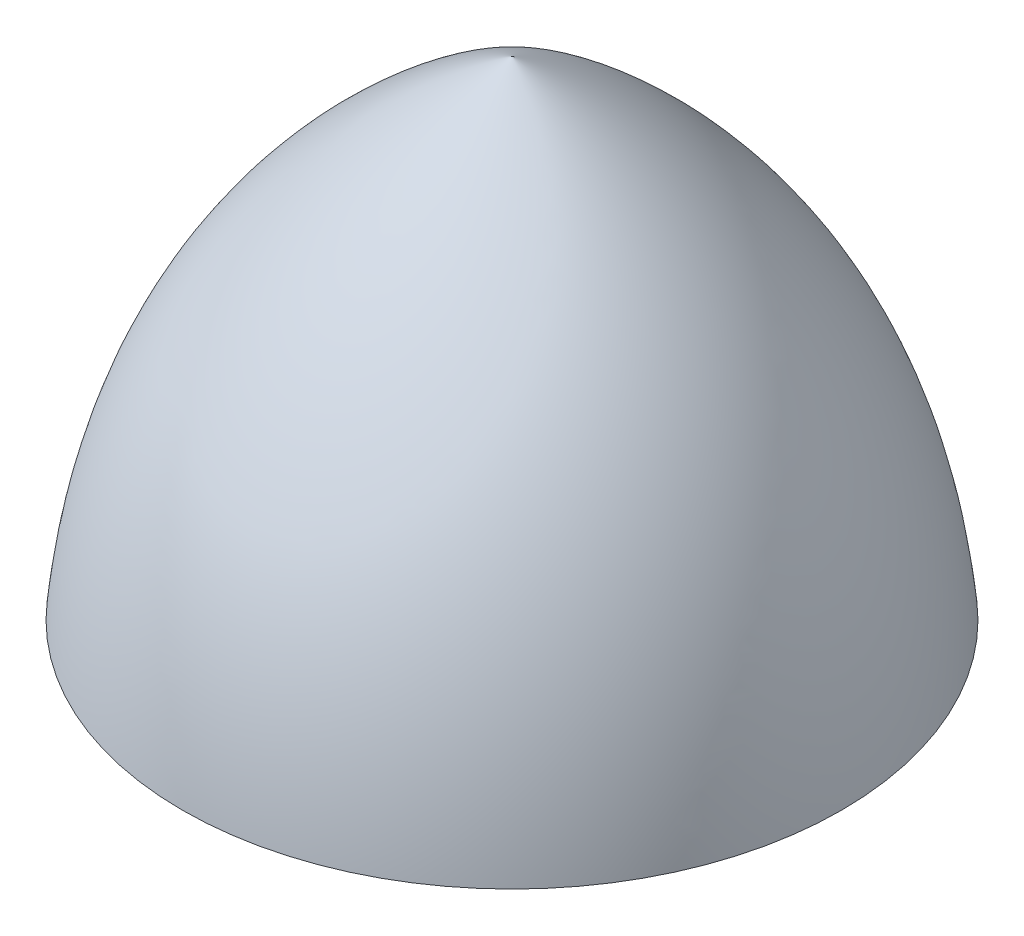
ISO-10303-21;
HEADER;
FILE_DESCRIPTION(('STEP AP214'),'2;1');
FILE_NAME('part.step','',(''),(''),'','','');
FILE_SCHEMA(('AUTOMOTIVE_DESIGN { 1 0 10303 214 1 1 1 1 }'));
ENDSEC;
DATA;
#1=APPLICATION_CONTEXT('core data for automotive mechanical design processes');
#2=APPLICATION_PROTOCOL_DEFINITION('international standard','automotive_design',2000,#1);
#3=PRODUCT_CONTEXT('',#1,'mechanical');
#4=PRODUCT('Part','Part','',(#3));
#5=PRODUCT_RELATED_PRODUCT_CATEGORY('part','',(#4));
#6=PRODUCT_DEFINITION_FORMATION('','',#4);
#7=PRODUCT_DEFINITION_CONTEXT('part definition',#1,'design');
#8=PRODUCT_DEFINITION('design','',#6,#7);
#9=PRODUCT_DEFINITION_SHAPE('','',#8);
#10=(LENGTH_UNIT() NAMED_UNIT(*) SI_UNIT(.MILLI.,.METRE.));
#11=(NAMED_UNIT(*) PLANE_ANGLE_UNIT() SI_UNIT($,.RADIAN.));
#12=(NAMED_UNIT(*) SI_UNIT($,.STERADIAN.) SOLID_ANGLE_UNIT());
#13=UNCERTAINTY_MEASURE_WITH_UNIT(LENGTH_MEASURE(1.E-05),#10,'distance_accuracy_value','');
#14=(GEOMETRIC_REPRESENTATION_CONTEXT(3) GLOBAL_UNCERTAINTY_ASSIGNED_CONTEXT((#13)) GLOBAL_UNIT_ASSIGNED_CONTEXT((#10,
#11,#12)) REPRESENTATION_CONTEXT('',''));
#15=CARTESIAN_POINT('',(0.,0.,0.));
#16=DIRECTION('',(0.,0.,1.));
#17=DIRECTION('',(1.,0.,0.));
#18=AXIS2_PLACEMENT_3D('',#15,#16,#17);
#19=CARTESIAN_POINT('',(-2.,28.2238006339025,0.));
#20=CARTESIAN_POINT('',(-20.9937933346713,18.3220100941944,0.));
#21=CARTESIAN_POINT('',(-23.,-2.8845099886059,0.));
#22=B_SPLINE_CURVE_WITH_KNOTS('',2,(#19,#20,#21),.UNSPECIFIED.,.F.,.F.,(3,3),(0.,1.),.UNSPECIFIED.);
#23=CARTESIAN_POINT('',(-2.,26.2238006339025,0.));
#24=DIRECTION('',(0.,-1.,0.));
#25=AXIS1_PLACEMENT('',#23,#24);
#26=SURFACE_OF_REVOLUTION('',#22,#25);
#27=CARTESIAN_POINT('',(-2.,-2.8845099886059,0.));
#28=DIRECTION('',(0.,-1.,0.));
#29=DIRECTION('',(0.,0.,-1.));
#30=AXIS2_PLACEMENT_3D('',#27,#28,#29);
#31=CIRCLE('',#30,21.);
#32=CARTESIAN_POINT('',(-2.,-2.8845099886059,-21.));
#33=VERTEX_POINT('',#32);
#34=EDGE_CURVE('E11',#33,#33,#31,.T.);
#35=ORIENTED_EDGE('',*,*,#34,.F.);
#36=EDGE_LOOP('',(#35));
#37=FACE_BOUND('',#36,.T.);
#38=CARTESIAN_POINT('',(-2.,28.2238006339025,0.));
#39=VERTEX_POINT('',#38);
#40=VERTEX_LOOP('',#39);
#41=FACE_BOUND('',#40,.T.);
#42=ADVANCED_FACE('F41',(#37,#41),#26,.T.);
#43=CARTESIAN_POINT('',(-23.,-2.8845099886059,0.));
#44=DIRECTION('',(0.,1.,0.));
#45=DIRECTION('',(0.,0.,1.));
#46=AXIS2_PLACEMENT_3D('',#43,#44,#45);
#47=PLANE('',#46);
#48=CARTESIAN_POINT('',(-2.,-2.8845099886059,0.));
#49=DIRECTION('',(0.,-1.,0.));
#50=DIRECTION('',(0.,0.,-1.));
#51=AXIS2_PLACEMENT_3D('',#48,#49,#50);
#52=CIRCLE('',#51,19.);
#53=CARTESIAN_POINT('',(-2.,-2.8845099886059,-19.));
#54=VERTEX_POINT('',#53);
#55=EDGE_CURVE('E47',#54,#54,#52,.T.);
#56=ORIENTED_EDGE('',*,*,#55,.F.);
#57=EDGE_LOOP('',(#56));
#58=FACE_BOUND('',#57,.T.);
#59=ORIENTED_EDGE('',*,*,#34,.T.);
#60=EDGE_LOOP('',(#59));
#61=FACE_BOUND('',#60,.T.);
#62=ADVANCED_FACE('F59',(#58,#61),#47,.F.);
#63=CARTESIAN_POINT('',(-21.,-2.8845099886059,0.));
#64=CARTESIAN_POINT('',(-19.9214905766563,17.4257626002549,0.));
#65=CARTESIAN_POINT('',(-2.,26.2238006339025,0.));
#66=B_SPLINE_CURVE_WITH_KNOTS('',2,(#63,#64,#65),.UNSPECIFIED.,.F.,.F.,(3,3),(0.,1.),.UNSPECIFIED.);
#67=CARTESIAN_POINT('',(-2.,26.2238006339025,0.));
#68=DIRECTION('',(0.,-1.,0.));
#69=AXIS1_PLACEMENT('',#67,#68);
#70=SURFACE_OF_REVOLUTION('',#66,#69);
#71=CARTESIAN_POINT('',(-2.,26.2238006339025,0.));
#72=VERTEX_POINT('',#71);
#73=VERTEX_LOOP('',#72);
#74=FACE_BOUND('',#73,.T.);
#75=ORIENTED_EDGE('',*,*,#55,.T.);
#76=EDGE_LOOP('',(#75));
#77=FACE_BOUND('',#76,.T.);
#78=ADVANCED_FACE('F54',(#74,#77),#70,.T.);
#79=CLOSED_SHELL('',(#42,#62,#78));
#80=MANIFOLD_SOLID_BREP('B2',#79);
#81=ADVANCED_BREP_SHAPE_REPRESENTATION('',(#18,#80),#14);
#82=SHAPE_DEFINITION_REPRESENTATION(#9,#81);
ENDSEC;
END-ISO-10303-21;
